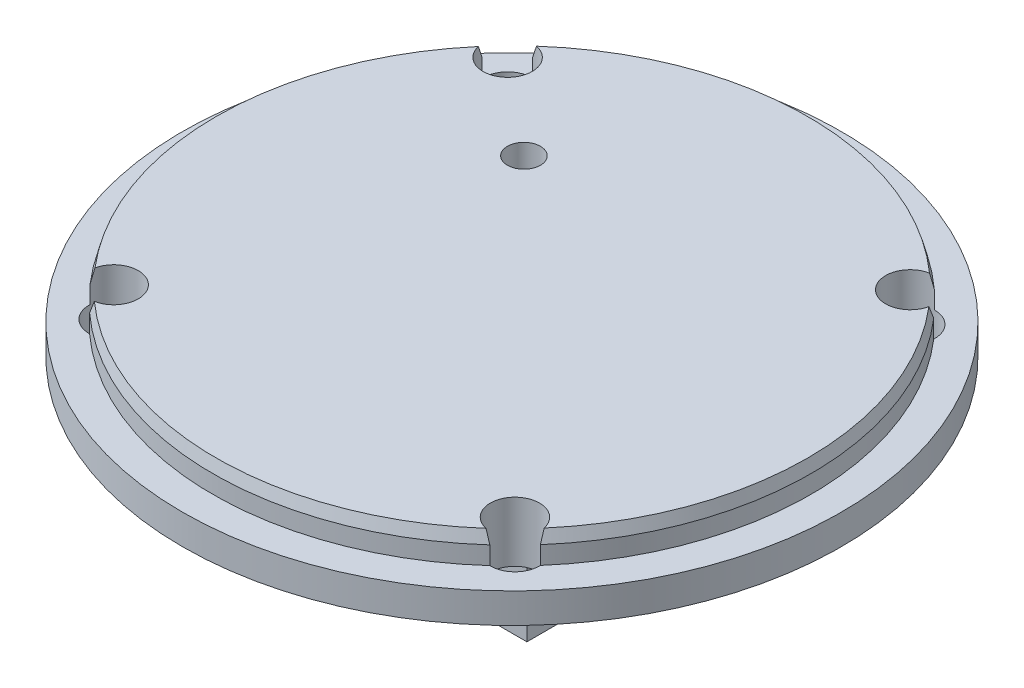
from build123d import *
from OCP.BRepFilletAPI import BRepFilletAPI_MakeChamfer

# Parameters (mm, degrees)
SKETCH_1_R          = 55
EXTRUDE_1_DEPTH     = 5
SKETCH_2_R          = 49.9
EXTRUDE_2_DEPTH     = 5
SKETCH_3_W          = 35
SKETCH_3_H          = 30
EXTRUDE_3_DEPTH     = 25
SKETCH_4_W          = 20.2
SKETCH_4_H          = 10.3
CUT_EXTRUDE_1_DEPTH = 93.466210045
SKETCH_5_R          = 4.1
CUT_EXTRUDE_2_DEPTH = 82.700673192
SKETCH_6_R          = 2.75
CUT_EXTRUDE_3_DEPTH = 86.293610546
CHAMFER1_SIZE       = 2
CHAMFER1_SIZE2      = 0.535898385


with BuildPart() as part:
    # Sketch 1 → Extrude 1 (new body)
    with BuildSketch(Plane(origin=(0, 0, 0), x_dir=(1, 0, 0), z_dir=(0, 1, 0))):
        with Locations(Location((0, 0, 0), (0, 0, 270))):
            Circle(SKETCH_1_R)
    extrude(amount=EXTRUDE_1_DEPTH)

    # Sketch 2 → Extrude 2 (add)
    with BuildSketch(Plane(origin=(0, 5, 0), x_dir=(1, 0, 0), z_dir=(0, 1, 0))):
        with Locations(Location((0, 0, 0), (0, 0, 270))):
            Circle(SKETCH_2_R)
    extrude(amount=EXTRUDE_2_DEPTH)

    # Sketch 3 → Extrude 3 (add)
    with BuildSketch(Plane.XZ):
        Rectangle(SKETCH_3_W, SKETCH_3_H)
    extrude(amount=EXTRUDE_3_DEPTH)

    # Sketch 4 → Cut-Extrude 1 (cut, through all)
    with BuildSketch(Plane.XY.offset(15)):
        with Locations((0, -12.5)):
            Rectangle(SKETCH_4_W, SKETCH_4_H)
    extrude(amount=-CUT_EXTRUDE_1_DEPTH, mode=Mode.SUBTRACT)

    # Sketch 5 → Cut-Extrude 2 (cut, through all)
    with BuildSketch(Plane.XZ):
        with Locations(Location((33.592198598, -32.871936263, 0), (0, 0, 270))):
            Circle(SKETCH_5_R)
        with Locations(Location((-33.591727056, -32.872418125, 0), (0, 0, 270))):
            Circle(SKETCH_5_R)
        with Locations(Location((-33.591727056, 32.872418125, 0), (0, 0, 270))):
            Circle(SKETCH_5_R)
        with Locations(Location((33.483215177, 32.983215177, 0), (0, 0, 270))):
            Circle(SKETCH_5_R)
    extrude(amount=-CUT_EXTRUDE_2_DEPTH, mode=Mode.SUBTRACT)

    # Sketch 6 → Cut-Extrude 3 (cut, through all)
    with BuildSketch(Plane(origin=(0, 10, 0), x_dir=(1, 0, 0), z_dir=(0, 1, 0))):
        with Locations(Location((-17.999856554, 19.999999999, 0), (0, 0, 270))):
            Circle(SKETCH_6_R)
    extrude(amount=-CUT_EXTRUDE_3_DEPTH, mode=Mode.SUBTRACT)

    # Chamfer1: one chamfer whose edges measure the first distance from different faces: ONE call of the kernel's chamfer builder (chamfer() names one face for all edges)
    chamfer1_edges_1 = [part.edges().sort_by_distance(p)[0] for p in [
        (0.000357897, 10, -49.899999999),
    ]]
    chamfer1_side_1 = [part.faces().sort_by_distance(p)[0] for p in [
        (0.000357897, 7.5, -49.899999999),
    ]]
    chamfer1_edges_2 = [part.edges().sort_by_distance(p)[0] for p in [
        (-49.9, 10, 0),
    ]]
    chamfer1_side_2 = [part.faces().sort_by_distance(p)[0] for p in [
        (-49.9, 7.5, 0),
    ]]
    chamfer1_edges_3 = [part.edges().sort_by_distance(p)[0] for p in [
        (-0.08242255, 10, 49.899931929),
    ]]
    chamfer1_side_3 = [part.faces().sort_by_distance(p)[0] for p in [
        (-0.08242255, 7.5, 49.899931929),
    ]]
    chamfer1_edges_4 = [part.edges().sort_by_distance(p)[0] for p in [
        (49.899931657, 10, 0.082587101),
    ]]
    chamfer1_side_4 = [part.faces().sort_by_distance(p)[0] for p in [
        (49.899931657, 7.5, 0.082587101),
    ]]
    chamfer1 = BRepFilletAPI_MakeChamfer(part.part.solid().wrapped)
    for e in chamfer1_edges_1:
        chamfer1.Add(CHAMFER1_SIZE, CHAMFER1_SIZE2, e.wrapped, chamfer1_side_1[0].wrapped)  # the first distance lies on this face
    for e in chamfer1_edges_2:
        chamfer1.Add(CHAMFER1_SIZE, CHAMFER1_SIZE2, e.wrapped, chamfer1_side_2[0].wrapped)  # the first distance lies on this face
    for e in chamfer1_edges_3:
        chamfer1.Add(CHAMFER1_SIZE, CHAMFER1_SIZE2, e.wrapped, chamfer1_side_3[0].wrapped)  # the first distance lies on this face
    for e in chamfer1_edges_4:
        chamfer1.Add(CHAMFER1_SIZE, CHAMFER1_SIZE2, e.wrapped, chamfer1_side_4[0].wrapped)  # the first distance lies on this face
    add(Compound.cast(chamfer1.Shape()), mode=Mode.REPLACE)


solid = part.part
